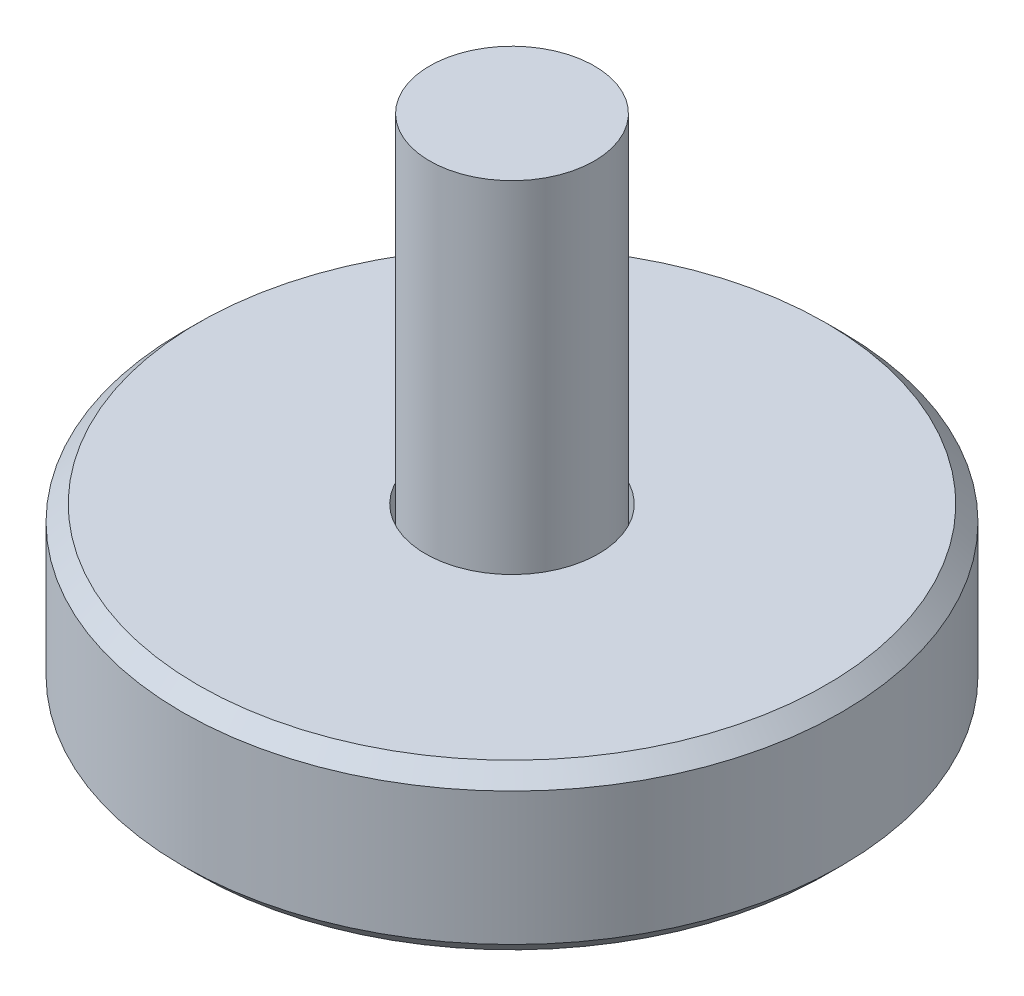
ISO-10303-21;
HEADER;
FILE_DESCRIPTION(('STEP AP214'),'2;1');
FILE_NAME('part.step','',(''),(''),'','','');
FILE_SCHEMA(('AUTOMOTIVE_DESIGN { 1 0 10303 214 1 1 1 1 }'));
ENDSEC;
DATA;
#1=APPLICATION_CONTEXT('core data for automotive mechanical design processes');
#2=APPLICATION_PROTOCOL_DEFINITION('international standard','automotive_design',2000,#1);
#3=PRODUCT_CONTEXT('',#1,'mechanical');
#4=PRODUCT('Part','Part','',(#3));
#5=PRODUCT_RELATED_PRODUCT_CATEGORY('part','',(#4));
#6=PRODUCT_DEFINITION_FORMATION('','',#4);
#7=PRODUCT_DEFINITION_CONTEXT('part definition',#1,'design');
#8=PRODUCT_DEFINITION('design','',#6,#7);
#9=PRODUCT_DEFINITION_SHAPE('','',#8);
#10=(LENGTH_UNIT() NAMED_UNIT(*) SI_UNIT(.MILLI.,.METRE.));
#11=(NAMED_UNIT(*) PLANE_ANGLE_UNIT() SI_UNIT($,.RADIAN.));
#12=(NAMED_UNIT(*) SI_UNIT($,.STERADIAN.) SOLID_ANGLE_UNIT());
#13=UNCERTAINTY_MEASURE_WITH_UNIT(LENGTH_MEASURE(1.E-05),#10,'distance_accuracy_value','');
#14=(GEOMETRIC_REPRESENTATION_CONTEXT(3) GLOBAL_UNCERTAINTY_ASSIGNED_CONTEXT((#13)) GLOBAL_UNIT_ASSIGNED_CONTEXT((#10,
#11,#12)) REPRESENTATION_CONTEXT('',''));
#15=CARTESIAN_POINT('',(0.,0.,0.));
#16=DIRECTION('',(0.,0.,1.));
#17=DIRECTION('',(1.,0.,0.));
#18=AXIS2_PLACEMENT_3D('',#15,#16,#17);
#19=CARTESIAN_POINT('',(0.,12.2,0.));
#20=DIRECTION('',(0.,1.,0.));
#21=DIRECTION('',(1.,0.,0.));
#22=AXIS2_PLACEMENT_3D('',#19,#20,#21);
#23=PLANE('',#22);
#24=CARTESIAN_POINT('',(0.,12.2,0.));
#25=DIRECTION('',(0.,1.,0.));
#26=DIRECTION('',(1.,0.,0.));
#27=AXIS2_PLACEMENT_3D('',#24,#25,#26);
#28=CIRCLE('',#27,2.);
#29=CARTESIAN_POINT('',(2.,12.2,0.));
#30=VERTEX_POINT('',#29);
#31=EDGE_CURVE('E12',#30,#30,#28,.T.);
#32=ORIENTED_EDGE('',*,*,#31,.T.);
#33=EDGE_LOOP('',(#32));
#34=FACE_BOUND('',#33,.T.);
#35=ADVANCED_FACE('F47',(#34),#23,.T.);
#36=CARTESIAN_POINT('',(0.,12.2,0.));
#37=DIRECTION('',(0.,1.,0.));
#38=DIRECTION('',(1.,0.,0.));
#39=AXIS2_PLACEMENT_3D('',#36,#37,#38);
#40=CYLINDRICAL_SURFACE('',#39,2.);
#41=CARTESIAN_POINT('',(0.,2.5,0.));
#42=DIRECTION('',(0.,1.,0.));
#43=DIRECTION('',(1.,0.,0.));
#44=AXIS2_PLACEMENT_3D('',#41,#42,#43);
#45=CIRCLE('',#44,2.);
#46=CARTESIAN_POINT('',(2.,2.5,0.));
#47=VERTEX_POINT('',#46);
#48=EDGE_CURVE('E54',#47,#47,#45,.T.);
#49=ORIENTED_EDGE('',*,*,#48,.T.);
#50=EDGE_LOOP('',(#49));
#51=FACE_BOUND('',#50,.T.);
#52=ORIENTED_EDGE('',*,*,#31,.F.);
#53=EDGE_LOOP('',(#52));
#54=FACE_BOUND('',#53,.T.);
#55=ADVANCED_FACE('F161',(#51,#54),#40,.T.);
#56=CARTESIAN_POINT('',(0.,2.5,0.));
#57=DIRECTION('',(0.,-1.,0.));
#58=DIRECTION('',(-1.,0.,0.));
#59=AXIS2_PLACEMENT_3D('',#56,#57,#58);
#60=CONICAL_SURFACE('',#59,2.,0.78539816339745);
#61=CARTESIAN_POINT('',(0.,0.500000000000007,0.));
#62=DIRECTION('',(0.,1.,0.));
#63=DIRECTION('',(1.,0.,0.));
#64=AXIS2_PLACEMENT_3D('',#61,#62,#63);
#65=CIRCLE('',#64,4.);
#66=CARTESIAN_POINT('',(4.,0.500000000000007,0.));
#67=VERTEX_POINT('',#66);
#68=EDGE_CURVE('E156',#67,#67,#65,.T.);
#69=ORIENTED_EDGE('',*,*,#68,.T.);
#70=EDGE_LOOP('',(#69));
#71=FACE_BOUND('',#70,.T.);
#72=ORIENTED_EDGE('',*,*,#48,.F.);
#73=EDGE_LOOP('',(#72));
#74=FACE_BOUND('',#73,.T.);
#75=ADVANCED_FACE('F164',(#71,#74),#60,.T.);
#76=CARTESIAN_POINT('',(0.,12.2,0.));
#77=DIRECTION('',(0.,1.,0.));
#78=DIRECTION('',(1.,0.,0.));
#79=AXIS2_PLACEMENT_3D('',#76,#77,#78);
#80=CYLINDRICAL_SURFACE('',#79,4.);
#81=CARTESIAN_POINT('',(0.,0.200000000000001,0.));
#82=DIRECTION('',(0.,1.,0.));
#83=DIRECTION('',(1.,0.,0.));
#84=AXIS2_PLACEMENT_3D('',#81,#82,#83);
#85=CIRCLE('',#84,4.);
#86=CARTESIAN_POINT('',(4.,0.200000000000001,0.));
#87=VERTEX_POINT('',#86);
#88=EDGE_CURVE('E148',#87,#87,#85,.T.);
#89=ORIENTED_EDGE('',*,*,#88,.T.);
#90=EDGE_LOOP('',(#89));
#91=FACE_BOUND('',#90,.T.);
#92=ORIENTED_EDGE('',*,*,#68,.F.);
#93=EDGE_LOOP('',(#92));
#94=FACE_BOUND('',#93,.T.);
#95=ADVANCED_FACE('F166',(#91,#94),#80,.T.);
#96=CARTESIAN_POINT('',(0.,0.200000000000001,4.));
#97=DIRECTION('',(0.,-1.,0.));
#98=DIRECTION('',(-1.,0.,0.));
#99=AXIS2_PLACEMENT_3D('',#96,#97,#98);
#100=PLANE('',#99);
#101=DIRECTION('',(0.866025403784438,0.,0.5));
#102=VECTOR('',#101,1.);
#103=CARTESIAN_POINT('',(0.,0.200000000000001,-1.44337567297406));
#104=LINE('',#103,#102);
#105=CARTESIAN_POINT('',(0.,0.200000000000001,-1.44337567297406));
#106=VERTEX_POINT('',#105);
#107=CARTESIAN_POINT('',(1.25,0.200000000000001,-0.721687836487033));
#108=VERTEX_POINT('',#107);
#109=EDGE_CURVE('E61',#106,#108,#104,.T.);
#110=ORIENTED_EDGE('',*,*,#109,.F.);
#111=DIRECTION('',(0.866025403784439,0.,-0.5));
#112=VECTOR('',#111,1.);
#113=CARTESIAN_POINT('',(-1.25,0.200000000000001,-0.721687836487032));
#114=LINE('',#113,#112);
#115=CARTESIAN_POINT('',(-1.25,0.200000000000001,-0.721687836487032));
#116=VERTEX_POINT('',#115);
#117=EDGE_CURVE('E144',#116,#106,#114,.T.);
#118=ORIENTED_EDGE('',*,*,#117,.F.);
#119=DIRECTION('',(0.,0.,-1.));
#120=VECTOR('',#119,1.);
#121=CARTESIAN_POINT('',(-1.25,0.200000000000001,0.721687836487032));
#122=LINE('',#121,#120);
#123=CARTESIAN_POINT('',(-1.25,0.200000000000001,0.721687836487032));
#124=VERTEX_POINT('',#123);
#125=EDGE_CURVE('E142',#124,#116,#122,.T.);
#126=ORIENTED_EDGE('',*,*,#125,.F.);
#127=DIRECTION('',(-0.866025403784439,0.,-0.5));
#128=VECTOR('',#127,1.);
#129=CARTESIAN_POINT('',(0.,0.200000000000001,1.44337567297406));
#130=LINE('',#129,#128);
#131=CARTESIAN_POINT('',(0.,0.200000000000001,1.44337567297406));
#132=VERTEX_POINT('',#131);
#133=EDGE_CURVE('E109',#132,#124,#130,.T.);
#134=ORIENTED_EDGE('',*,*,#133,.F.);
#135=DIRECTION('',(-0.866025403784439,0.,0.5));
#136=VECTOR('',#135,1.);
#137=CARTESIAN_POINT('',(1.25,0.200000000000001,0.721687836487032));
#138=LINE('',#137,#136);
#139=CARTESIAN_POINT('',(1.25,0.200000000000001,0.721687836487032));
#140=VERTEX_POINT('',#139);
#141=EDGE_CURVE('E138',#140,#132,#138,.T.);
#142=ORIENTED_EDGE('',*,*,#141,.F.);
#143=DIRECTION('',(0.,0.,1.));
#144=VECTOR('',#143,1.);
#145=CARTESIAN_POINT('',(1.25,0.200000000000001,-0.721687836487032));
#146=LINE('',#145,#144);
#147=EDGE_CURVE('E135',#108,#140,#146,.T.);
#148=ORIENTED_EDGE('',*,*,#147,.F.);
#149=EDGE_LOOP('',(#110,#118,#126,#134,#142,#148));
#150=FACE_BOUND('',#149,.T.);
#151=ORIENTED_EDGE('',*,*,#88,.F.);
#152=EDGE_LOOP('',(#151));
#153=FACE_BOUND('',#152,.T.);
#154=ADVANCED_FACE('F173',(#150,#153),#100,.T.);
#155=CARTESIAN_POINT('',(0.,2.2,-1.44337567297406));
#156=DIRECTION('',(0.5,0.,-0.866025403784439));
#157=DIRECTION('',(-0.866025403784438,0.,-0.5));
#158=AXIS2_PLACEMENT_3D('',#155,#156,#157);
#159=PLANE('',#158);
#160=ORIENTED_EDGE('',*,*,#109,.T.);
#161=DIRECTION('',(0.,-1.,0.));
#162=VECTOR('',#161,1.);
#163=CARTESIAN_POINT('',(1.25,2.2,-0.721687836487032));
#164=LINE('',#163,#162);
#165=CARTESIAN_POINT('',(1.25,2.2,-0.721687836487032));
#166=VERTEX_POINT('',#165);
#167=EDGE_CURVE('E91',#166,#108,#164,.T.);
#168=ORIENTED_EDGE('',*,*,#167,.F.);
#169=DIRECTION('',(0.866025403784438,0.,0.5));
#170=VECTOR('',#169,1.);
#171=CARTESIAN_POINT('',(0.,2.2,-1.44337567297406));
#172=LINE('',#171,#170);
#173=CARTESIAN_POINT('',(0.,2.2,-1.44337567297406));
#174=VERTEX_POINT('',#173);
#175=EDGE_CURVE('E146',#174,#166,#172,.T.);
#176=ORIENTED_EDGE('',*,*,#175,.F.);
#177=DIRECTION('',(0.,-1.,0.));
#178=VECTOR('',#177,1.);
#179=CARTESIAN_POINT('',(0.,2.2,-1.44337567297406));
#180=LINE('',#179,#178);
#181=EDGE_CURVE('E69',#174,#106,#180,.T.);
#182=ORIENTED_EDGE('',*,*,#181,.T.);
#183=EDGE_LOOP('',(#160,#168,#176,#182));
#184=FACE_BOUND('',#183,.T.);
#185=ADVANCED_FACE('F198',(#184),#159,.F.);
#186=CARTESIAN_POINT('',(-1.25,2.2,-0.721687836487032));
#187=DIRECTION('',(-0.5,0.,-0.866025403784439));
#188=DIRECTION('',(-0.866025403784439,0.,0.5));
#189=AXIS2_PLACEMENT_3D('',#186,#187,#188);
#190=PLANE('',#189);
#191=ORIENTED_EDGE('',*,*,#117,.T.);
#192=ORIENTED_EDGE('',*,*,#181,.F.);
#193=DIRECTION('',(0.866025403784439,0.,-0.5));
#194=VECTOR('',#193,1.);
#195=CARTESIAN_POINT('',(-1.25,2.2,-0.721687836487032));
#196=LINE('',#195,#194);
#197=CARTESIAN_POINT('',(-1.25,2.2,-0.721687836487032));
#198=VERTEX_POINT('',#197);
#199=EDGE_CURVE('E121',#198,#174,#196,.T.);
#200=ORIENTED_EDGE('',*,*,#199,.F.);
#201=DIRECTION('',(0.,-1.,0.));
#202=VECTOR('',#201,1.);
#203=CARTESIAN_POINT('',(-1.25,2.2,-0.721687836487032));
#204=LINE('',#203,#202);
#205=EDGE_CURVE('E113',#198,#116,#204,.T.);
#206=ORIENTED_EDGE('',*,*,#205,.T.);
#207=EDGE_LOOP('',(#191,#192,#200,#206));
#208=FACE_BOUND('',#207,.T.);
#209=ADVANCED_FACE('F206',(#208),#190,.F.);
#210=CARTESIAN_POINT('',(-1.25,2.2,0.721687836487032));
#211=DIRECTION('',(-1.,0.,0.));
#212=DIRECTION('',(0.,0.,1.));
#213=AXIS2_PLACEMENT_3D('',#210,#211,#212);
#214=PLANE('',#213);
#215=ORIENTED_EDGE('',*,*,#125,.T.);
#216=ORIENTED_EDGE('',*,*,#205,.F.);
#217=DIRECTION('',(0.,0.,-1.));
#218=VECTOR('',#217,1.);
#219=CARTESIAN_POINT('',(-1.25,2.2,0.721687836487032));
#220=LINE('',#219,#218);
#221=CARTESIAN_POINT('',(-1.25,2.2,0.721687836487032));
#222=VERTEX_POINT('',#221);
#223=EDGE_CURVE('E117',#222,#198,#220,.T.);
#224=ORIENTED_EDGE('',*,*,#223,.F.);
#225=DIRECTION('',(0.,-1.,0.));
#226=VECTOR('',#225,1.);
#227=CARTESIAN_POINT('',(-1.25,2.2,0.721687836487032));
#228=LINE('',#227,#226);
#229=EDGE_CURVE('E102',#222,#124,#228,.T.);
#230=ORIENTED_EDGE('',*,*,#229,.T.);
#231=EDGE_LOOP('',(#215,#216,#224,#230));
#232=FACE_BOUND('',#231,.T.);
#233=ADVANCED_FACE('F118',(#232),#214,.F.);
#234=CARTESIAN_POINT('',(0.,2.2,1.44337567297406));
#235=DIRECTION('',(-0.5,0.,0.866025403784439));
#236=DIRECTION('',(0.866025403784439,0.,0.5));
#237=AXIS2_PLACEMENT_3D('',#234,#235,#236);
#238=PLANE('',#237);
#239=ORIENTED_EDGE('',*,*,#133,.T.);
#240=ORIENTED_EDGE('',*,*,#229,.F.);
#241=DIRECTION('',(-0.866025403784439,0.,-0.5));
#242=VECTOR('',#241,1.);
#243=CARTESIAN_POINT('',(0.,2.2,1.44337567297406));
#244=LINE('',#243,#242);
#245=CARTESIAN_POINT('',(0.,2.2,1.44337567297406));
#246=VERTEX_POINT('',#245);
#247=EDGE_CURVE('E106',#246,#222,#244,.T.);
#248=ORIENTED_EDGE('',*,*,#247,.F.);
#249=DIRECTION('',(0.,-1.,0.));
#250=VECTOR('',#249,1.);
#251=CARTESIAN_POINT('',(0.,2.2,1.44337567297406));
#252=LINE('',#251,#250);
#253=EDGE_CURVE('E114',#246,#132,#252,.T.);
#254=ORIENTED_EDGE('',*,*,#253,.T.);
#255=EDGE_LOOP('',(#239,#240,#248,#254));
#256=FACE_BOUND('',#255,.T.);
#257=ADVANCED_FACE('F104',(#256),#238,.F.);
#258=CARTESIAN_POINT('',(1.25,2.2,0.721687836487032));
#259=DIRECTION('',(0.5,0.,0.866025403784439));
#260=DIRECTION('',(0.866025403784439,0.,-0.5));
#261=AXIS2_PLACEMENT_3D('',#258,#259,#260);
#262=PLANE('',#261);
#263=ORIENTED_EDGE('',*,*,#141,.T.);
#264=ORIENTED_EDGE('',*,*,#253,.F.);
#265=DIRECTION('',(-0.866025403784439,0.,0.5));
#266=VECTOR('',#265,1.);
#267=CARTESIAN_POINT('',(1.25,2.2,0.721687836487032));
#268=LINE('',#267,#266);
#269=CARTESIAN_POINT('',(1.25,2.2,0.721687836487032));
#270=VERTEX_POINT('',#269);
#271=EDGE_CURVE('E127',#270,#246,#268,.T.);
#272=ORIENTED_EDGE('',*,*,#271,.F.);
#273=DIRECTION('',(0.,-1.,0.));
#274=VECTOR('',#273,1.);
#275=CARTESIAN_POINT('',(1.25,2.2,0.721687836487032));
#276=LINE('',#275,#274);
#277=EDGE_CURVE('E151',#270,#140,#276,.T.);
#278=ORIENTED_EDGE('',*,*,#277,.T.);
#279=EDGE_LOOP('',(#263,#264,#272,#278));
#280=FACE_BOUND('',#279,.T.);
#281=ADVANCED_FACE('F225',(#280),#262,.F.);
#282=CARTESIAN_POINT('',(1.25,2.2,-0.721687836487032));
#283=DIRECTION('',(1.,0.,0.));
#284=DIRECTION('',(0.,-1.,0.));
#285=AXIS2_PLACEMENT_3D('',#282,#283,#284);
#286=PLANE('',#285);
#287=ORIENTED_EDGE('',*,*,#147,.T.);
#288=ORIENTED_EDGE('',*,*,#277,.F.);
#289=DIRECTION('',(0.,0.,1.));
#290=VECTOR('',#289,1.);
#291=CARTESIAN_POINT('',(1.25,2.2,-0.721687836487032));
#292=LINE('',#291,#290);
#293=EDGE_CURVE('E129',#166,#270,#292,.T.);
#294=ORIENTED_EDGE('',*,*,#293,.F.);
#295=ORIENTED_EDGE('',*,*,#167,.T.);
#296=EDGE_LOOP('',(#287,#288,#294,#295));
#297=FACE_BOUND('',#296,.T.);
#298=ADVANCED_FACE('F232',(#297),#286,.F.);
#299=CARTESIAN_POINT('',(2.5,2.2,0.));
#300=DIRECTION('',(0.,-1.,0.));
#301=DIRECTION('',(-1.,0.,0.));
#302=AXIS2_PLACEMENT_3D('',#299,#300,#301);
#303=PLANE('',#302);
#304=ORIENTED_EDGE('',*,*,#175,.T.);
#305=ORIENTED_EDGE('',*,*,#293,.T.);
#306=ORIENTED_EDGE('',*,*,#271,.T.);
#307=ORIENTED_EDGE('',*,*,#247,.T.);
#308=ORIENTED_EDGE('',*,*,#223,.T.);
#309=ORIENTED_EDGE('',*,*,#199,.T.);
#310=EDGE_LOOP('',(#304,#305,#306,#307,#308,#309));
#311=FACE_BOUND('',#310,.T.);
#312=ADVANCED_FACE('F124',(#311),#303,.T.);
#313=CLOSED_SHELL('',(#35,#55,#75,#95,#154,#185,#209,#233,#257,#281,#298,#312));
#314=MANIFOLD_SOLID_BREP('B2',#313);
#315=CARTESIAN_POINT('',(0.,3.9878,0.));
#316=DIRECTION('',(0.,-1.,0.));
#317=DIRECTION('',(0.,0.,-1.));
#318=AXIS2_PLACEMENT_3D('',#315,#316,#317);
#319=CYLINDRICAL_SURFACE('',#318,8.001);
#320=CARTESIAN_POINT('',(0.,0.381000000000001,0.));
#321=DIRECTION('',(0.,1.,0.));
#322=DIRECTION('',(0.,0.,1.));
#323=AXIS2_PLACEMENT_3D('',#320,#321,#322);
#324=CIRCLE('',#323,8.001);
#325=CARTESIAN_POINT('',(0.,0.381000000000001,8.001));
#326=VERTEX_POINT('',#325);
#327=EDGE_CURVE('E270',#326,#326,#324,.T.);
#328=ORIENTED_EDGE('',*,*,#327,.T.);
#329=EDGE_LOOP('',(#328));
#330=FACE_BOUND('',#329,.T.);
#331=CARTESIAN_POINT('',(0.,3.60679999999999,0.));
#332=DIRECTION('',(0.,1.,0.));
#333=DIRECTION('',(0.,0.,1.));
#334=AXIS2_PLACEMENT_3D('',#331,#332,#333);
#335=CIRCLE('',#334,8.001);
#336=CARTESIAN_POINT('',(0.,3.60679999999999,-8.001));
#337=VERTEX_POINT('',#336);
#338=EDGE_CURVE('E274',#337,#337,#335,.F.);
#339=ORIENTED_EDGE('',*,*,#338,.T.);
#340=EDGE_LOOP('',(#339));
#341=FACE_BOUND('',#340,.T.);
#342=ADVANCED_FACE('F259',(#330,#341),#319,.T.);
#343=CARTESIAN_POINT('',(0.,3.9878,0.));
#344=DIRECTION('',(0.,1.,0.));
#345=DIRECTION('',(0.,0.,1.));
#346=AXIS2_PLACEMENT_3D('',#343,#344,#345);
#347=PLANE('',#346);
#348=CARTESIAN_POINT('',(0.,3.9878,0.));
#349=DIRECTION('',(0.,-1.,0.));
#350=DIRECTION('',(0.,0.,-1.));
#351=AXIS2_PLACEMENT_3D('',#348,#349,#350);
#352=CIRCLE('',#351,2.1);
#353=CARTESIAN_POINT('',(0.,3.9878,-2.1));
#354=VERTEX_POINT('',#353);
#355=EDGE_CURVE('E285',#354,#354,#352,.T.);
#356=ORIENTED_EDGE('',*,*,#355,.T.);
#357=EDGE_LOOP('',(#356));
#358=FACE_BOUND('',#357,.T.);
#359=CARTESIAN_POINT('',(0.,3.9878,0.));
#360=DIRECTION('',(0.,1.,0.));
#361=DIRECTION('',(0.,0.,1.));
#362=AXIS2_PLACEMENT_3D('',#359,#360,#361);
#363=CIRCLE('',#362,7.61999999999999);
#364=CARTESIAN_POINT('',(0.,3.9878,-7.61999999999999));
#365=VERTEX_POINT('',#364);
#366=EDGE_CURVE('E46',#365,#365,#363,.T.);
#367=ORIENTED_EDGE('',*,*,#366,.T.);
#368=EDGE_LOOP('',(#367));
#369=FACE_BOUND('',#368,.T.);
#370=ADVANCED_FACE('F289',(#358,#369),#347,.T.);
#371=CARTESIAN_POINT('',(0.,0.,0.));
#372=DIRECTION('',(0.,1.,0.));
#373=DIRECTION('',(0.,0.,1.));
#374=AXIS2_PLACEMENT_3D('',#371,#372,#373);
#375=PLANE('',#374);
#376=CARTESIAN_POINT('',(0.,0.,0.));
#377=DIRECTION('',(0.,-1.,0.));
#378=DIRECTION('',(0.,0.,-1.));
#379=AXIS2_PLACEMENT_3D('',#376,#377,#378);
#380=CIRCLE('',#379,4.50000000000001);
#381=CARTESIAN_POINT('',(0.,0.,-4.50000000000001));
#382=VERTEX_POINT('',#381);
#383=EDGE_CURVE('E279',#382,#382,#380,.T.);
#384=ORIENTED_EDGE('',*,*,#383,.F.);
#385=EDGE_LOOP('',(#384));
#386=FACE_BOUND('',#385,.T.);
#387=CARTESIAN_POINT('',(0.,0.,0.));
#388=DIRECTION('',(0.,1.,0.));
#389=DIRECTION('',(0.,0.,1.));
#390=AXIS2_PLACEMENT_3D('',#387,#388,#389);
#391=CIRCLE('',#390,7.62);
#392=CARTESIAN_POINT('',(0.,0.,7.62));
#393=VERTEX_POINT('',#392);
#394=EDGE_CURVE('E266',#393,#393,#391,.F.);
#395=ORIENTED_EDGE('',*,*,#394,.T.);
#396=EDGE_LOOP('',(#395));
#397=FACE_BOUND('',#396,.T.);
#398=ADVANCED_FACE('F303',(#386,#397),#375,.F.);
#399=CARTESIAN_POINT('',(0.,0.381000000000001,0.));
#400=DIRECTION('',(0.,1.,0.));
#401=DIRECTION('',(0.,0.,1.));
#402=AXIS2_PLACEMENT_3D('',#399,#400,#401);
#403=CONICAL_SURFACE('',#402,8.001,0.785398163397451);
#404=ORIENTED_EDGE('',*,*,#394,.F.);
#405=EDGE_LOOP('',(#404));
#406=FACE_BOUND('',#405,.T.);
#407=ORIENTED_EDGE('',*,*,#327,.F.);
#408=EDGE_LOOP('',(#407));
#409=FACE_BOUND('',#408,.T.);
#410=ADVANCED_FACE('F305',(#406,#409),#403,.T.);
#411=CARTESIAN_POINT('',(0.,3.9878,0.));
#412=DIRECTION('',(0.,-1.,0.));
#413=DIRECTION('',(0.,0.,-1.));
#414=AXIS2_PLACEMENT_3D('',#411,#412,#413);
#415=CONICAL_SURFACE('',#414,7.61999999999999,0.785398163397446);
#416=CARTESIAN_POINT('',(0.,3.60679999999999,-8.001));
#417=CARTESIAN_POINT('',(0.,3.61076874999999,-7.99703125));
#418=CARTESIAN_POINT('',(0.,3.61473749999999,-7.9930625));
#419=CARTESIAN_POINT('',(0.,3.62267499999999,-7.985125));
#420=CARTESIAN_POINT('',(0.,3.62664374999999,-7.98115625));
#421=CARTESIAN_POINT('',(0.,3.63458124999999,-7.97321875));
#422=CARTESIAN_POINT('',(0.,3.63854999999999,-7.96925));
#423=CARTESIAN_POINT('',(0.,3.64648749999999,-7.9613125));
#424=CARTESIAN_POINT('',(0.,3.65045624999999,-7.95734375));
#425=CARTESIAN_POINT('',(0.,3.65839374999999,-7.94940625));
#426=CARTESIAN_POINT('',(0.,3.66236249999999,-7.9454375));
#427=CARTESIAN_POINT('',(0.,3.67029999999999,-7.9375));
#428=CARTESIAN_POINT('',(0.,3.67426874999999,-7.93353125));
#429=CARTESIAN_POINT('',(0.,3.68220624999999,-7.92559375));
#430=CARTESIAN_POINT('',(0.,3.68617499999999,-7.921625));
#431=CARTESIAN_POINT('',(0.,3.69411249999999,-7.9136875));
#432=CARTESIAN_POINT('',(0.,3.69808124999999,-7.90971875));
#433=CARTESIAN_POINT('',(0.,3.70601874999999,-7.90178125));
#434=CARTESIAN_POINT('',(0.,3.70998749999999,-7.8978125));
#435=CARTESIAN_POINT('',(0.,3.71792499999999,-7.889875));
#436=CARTESIAN_POINT('',(0.,3.72189374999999,-7.88590625));
#437=CARTESIAN_POINT('',(0.,3.72983124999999,-7.87796875));
#438=CARTESIAN_POINT('',(0.,3.7338,-7.874));
#439=CARTESIAN_POINT('',(0.,3.7417375,-7.8660625));
#440=CARTESIAN_POINT('',(0.,3.74570625,-7.86209375));
#441=CARTESIAN_POINT('',(0.,3.75364375,-7.85415625));
#442=CARTESIAN_POINT('',(0.,3.7576125,-7.8501875));
#443=CARTESIAN_POINT('',(0.,3.76555,-7.84225));
#444=CARTESIAN_POINT('',(0.,3.76951875,-7.83828125));
#445=CARTESIAN_POINT('',(0.,3.77745625,-7.83034375));
#446=CARTESIAN_POINT('',(0.,3.781425,-7.826375));
#447=CARTESIAN_POINT('',(0.,3.7893625,-7.8184375));
#448=CARTESIAN_POINT('',(0.,3.79333125,-7.81446875));
#449=CARTESIAN_POINT('',(0.,3.80126875,-7.80653125));
#450=CARTESIAN_POINT('',(0.,3.8052375,-7.8025625));
#451=CARTESIAN_POINT('',(0.,3.813175,-7.794625));
#452=CARTESIAN_POINT('',(0.,3.81714375,-7.79065625));
#453=CARTESIAN_POINT('',(0.,3.82508125,-7.78271875));
#454=CARTESIAN_POINT('',(0.,3.82905,-7.77875));
#455=CARTESIAN_POINT('',(0.,3.8369875,-7.7708125));
#456=CARTESIAN_POINT('',(0.,3.84095625,-7.76684375));
#457=CARTESIAN_POINT('',(0.,3.84889375,-7.75890625));
#458=CARTESIAN_POINT('',(0.,3.8528625,-7.7549375));
#459=CARTESIAN_POINT('',(0.,3.8608,-7.747));
#460=CARTESIAN_POINT('',(0.,3.86476875,-7.74303125));
#461=CARTESIAN_POINT('',(0.,3.87270625,-7.73509375));
#462=CARTESIAN_POINT('',(0.,3.876675,-7.731125));
#463=CARTESIAN_POINT('',(0.,3.8846125,-7.7231875));
#464=CARTESIAN_POINT('',(0.,3.88858125,-7.71921875));
#465=CARTESIAN_POINT('',(0.,3.89651875,-7.71128125));
#466=CARTESIAN_POINT('',(0.,3.9004875,-7.7073125));
#467=CARTESIAN_POINT('',(0.,3.908425,-7.699375));
#468=CARTESIAN_POINT('',(0.,3.91239375,-7.69540625));
#469=CARTESIAN_POINT('',(0.,3.92033125,-7.68746875));
#470=CARTESIAN_POINT('',(0.,3.9243,-7.6835));
#471=CARTESIAN_POINT('',(0.,3.9322375,-7.6755625));
#472=CARTESIAN_POINT('',(0.,3.93620625,-7.67159375));
#473=CARTESIAN_POINT('',(0.,3.94414375,-7.66365625));
#474=CARTESIAN_POINT('',(0.,3.9481125,-7.6596875));
#475=CARTESIAN_POINT('',(0.,3.95605,-7.65175));
#476=CARTESIAN_POINT('',(0.,3.96001875,-7.64778125));
#477=CARTESIAN_POINT('',(0.,3.96795625,-7.63984375));
#478=CARTESIAN_POINT('',(0.,3.971925,-7.635875));
#479=CARTESIAN_POINT('',(0.,3.9798625,-7.6279375));
#480=CARTESIAN_POINT('',(0.,3.98383125,-7.62396875));
#481=CARTESIAN_POINT('',(0.,3.9878,-7.61999999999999));
#482=B_SPLINE_CURVE_WITH_KNOTS('',3,(#416,#417,#418,#419,#420,#421,#422,#423,#424,#425,#426,
#427,#428,#429,#430,#431,#432,#433,#434,#435,#436,#437,#438,#439,#440,#441,#442,#443,#444,#445,
#446,#447,#448,#449,#450,#451,#452,#453,#454,#455,#456,#457,#458,#459,#460,#461,#462,#463,#464,
#465,#466,#467,#468,#469,#470,#471,#472,#473,#474,#475,#476,#477,#478,#479,#480,#481),
.UNSPECIFIED.,.F.,.F.,(4,2,2,2,2,2,2,2,2,2,2,2,2,2,2,2,2,2,2,2,2,2,2,2,2,2,2,2,2,2,2,2,4),(0.,
0.0168379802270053,0.0336759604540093,0.0505139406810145,0.0673519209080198,0.0841899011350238,
0.101027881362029,0.117865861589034,0.13470384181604,0.151541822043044,0.168379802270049,
0.185217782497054,0.202055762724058,0.218893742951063,0.235731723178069,0.252569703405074,
0.269407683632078,0.286245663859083,0.303083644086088,0.319921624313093,0.336759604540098,
0.353597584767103,0.370435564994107,0.387273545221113,0.404111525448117,0.420949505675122,
0.437787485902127,0.454625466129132,0.471463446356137,0.488301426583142,0.505139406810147,
0.521977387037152,0.538815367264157),.UNSPECIFIED.);
#483=EDGE_CURVE('BSEAM261',#337,#365,#482,.T.);
#484=ORIENTED_EDGE('',*,*,#338,.F.);
#485=ORIENTED_EDGE('',*,*,#366,.F.);
#486=ORIENTED_EDGE('',*,*,#483,.T.);
#487=ORIENTED_EDGE('',*,*,#483,.F.);
#488=EDGE_LOOP('',(#484,#486,#485,#487));
#489=FACE_BOUND('',#488,.T.);
#490=ADVANCED_FACE('F261',(#489),#415,.T.);
#491=CARTESIAN_POINT('',(0.,0.,0.));
#492=DIRECTION('',(0.,-1.,0.));
#493=DIRECTION('',(0.,0.,-1.));
#494=AXIS2_PLACEMENT_3D('',#491,#492,#493);
#495=CONICAL_SURFACE('',#494,4.50000000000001,0.78539816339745);
#496=CARTESIAN_POINT('',(0.,2.4,0.));
#497=DIRECTION('',(0.,-1.,0.));
#498=DIRECTION('',(0.,0.,-1.));
#499=AXIS2_PLACEMENT_3D('',#496,#497,#498);
#500=CIRCLE('',#499,2.1);
#501=CARTESIAN_POINT('',(0.,2.4,-2.1));
#502=VERTEX_POINT('',#501);
#503=EDGE_CURVE('E282',#502,#502,#500,.T.);
#504=ORIENTED_EDGE('',*,*,#503,.F.);
#505=EDGE_LOOP('',(#504));
#506=FACE_BOUND('',#505,.T.);
#507=ORIENTED_EDGE('',*,*,#383,.T.);
#508=EDGE_LOOP('',(#507));
#509=FACE_BOUND('',#508,.T.);
#510=ADVANCED_FACE('F294',(#506,#509),#495,.F.);
#511=CARTESIAN_POINT('',(0.,-2.0500103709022,0.));
#512=DIRECTION('',(0.,-1.,0.));
#513=DIRECTION('',(0.,0.,-1.));
#514=AXIS2_PLACEMENT_3D('',#511,#512,#513);
#515=CYLINDRICAL_SURFACE('',#514,2.1);
#516=ORIENTED_EDGE('',*,*,#355,.F.);
#517=EDGE_LOOP('',(#516));
#518=FACE_BOUND('',#517,.T.);
#519=ORIENTED_EDGE('',*,*,#503,.T.);
#520=EDGE_LOOP('',(#519));
#521=FACE_BOUND('',#520,.T.);
#522=ADVANCED_FACE('F291',(#518,#521),#515,.F.);
#523=CLOSED_SHELL('',(#342,#370,#398,#410,#490,#510,#522));
#524=MANIFOLD_SOLID_BREP('B6',#523);
#525=ADVANCED_BREP_SHAPE_REPRESENTATION('',(#18,#314,#524),#14);
#526=SHAPE_DEFINITION_REPRESENTATION(#9,#525);
ENDSEC;
END-ISO-10303-21;
